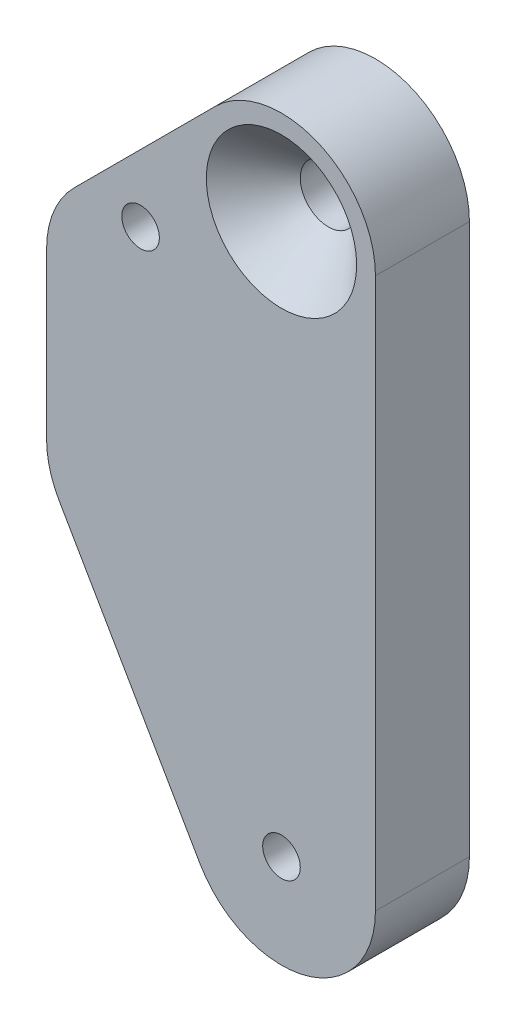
from build123d import *

# Parameters (mm, degrees)
ESQUISSE1_R                  = 3
ESQUISSE1_R_2                = 2
BOSS_EXTRU_1_DEPTH           = 10
CHANFREIN1_SIZE              = 5
ENL_V_MAT_EXTRU_1_REACH      = 81.057
ENL_V_MAT_EXTRU_1_END_RADIUS = 2
ESQUISSE2_R                  = 2


with BuildPart() as part:
    # Esquisse1 → Boss.-Extru.1 (new body)
    with BuildSketch(Plane.XY):
        with BuildLine():
            Line((-15, 115), (-15, 56.456439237))
            ThreePointArc((-15, 56.456439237), (-22.411809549, 46.797180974), (-33.660254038, 51.456439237))
            Line((-33.660254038, 51.456439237), (-48.660254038, 77.437201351))
            ThreePointArc((-48.660254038, 77.437201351), (-49.659258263, 79.8490109), (-50, 82.437201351))
            Line((-50, 82.437201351), (-50, 100))
            ThreePointArc((-50, 100), (-49.238795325, 103.826834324), (-47.071067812, 107.071067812))
            Line((-47.071067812, 107.071067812), (-32.071067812, 122.071067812))
            ThreePointArc((-32.071067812, 122.071067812), (-21.173165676, 124.238795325), (-15, 115))
        make_face()
        with Locations((-25, 115)):
            Circle(ESQUISSE1_R, mode=Mode.SUBTRACT)
        with Locations((-40, 107)):
            Circle(ESQUISSE1_R_2, mode=Mode.SUBTRACT)
        with Locations((-25, 56.456439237)):
            Circle(ESQUISSE1_R_2, mode=Mode.SUBTRACT)
    extrude(amount=BOSS_EXTRU_1_DEPTH)

    # Chanfrein1
    chanfrein1_edges = [part.edges().sort_by_distance(p)[0] for p in [
        (-28, 115, 10),
    ]]
    chamfer(chanfrein1_edges, length=CHANFREIN1_SIZE)

    # Enl_v. mat.-Extru.1: up to this cylinder (the profile starts outside it)
    enl_v_mat_extru_1_end = Plane(origin=(-40, 107, 5), z_dir=(0, 0, -1)) * Cylinder(ENL_V_MAT_EXTRU_1_END_RADIUS, 167.114, mode=Mode.PRIVATE)
    # Esquisse2 → Enl_v. mat.-Extru.1 (cut, up to the surface)
    with BuildSketch(Plane(origin=(-77.071067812, 77.071067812, 0), x_dir=(0, 0, 1), z_dir=(-0.7071067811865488, 0.7071067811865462, 0)), mode=Mode.PRIVATE) as enl_v_mat_extru_1_sk1:
        with Locations(Location((5, 47.376154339, 0), (0, 0, 270))):
            Circle(ESQUISSE2_R)
    enl_v_mat_extru_1_tool1 = extrude(enl_v_mat_extru_1_sk1.sketch, amount=-ENL_V_MAT_EXTRU_1_REACH, mode=Mode.PRIVATE) - enl_v_mat_extru_1_end
    add(enl_v_mat_extru_1_tool1.solids().sort_by_distance((-43.571068, 110.571068, 5))[0], mode=Mode.SUBTRACT)


solid = part.part
